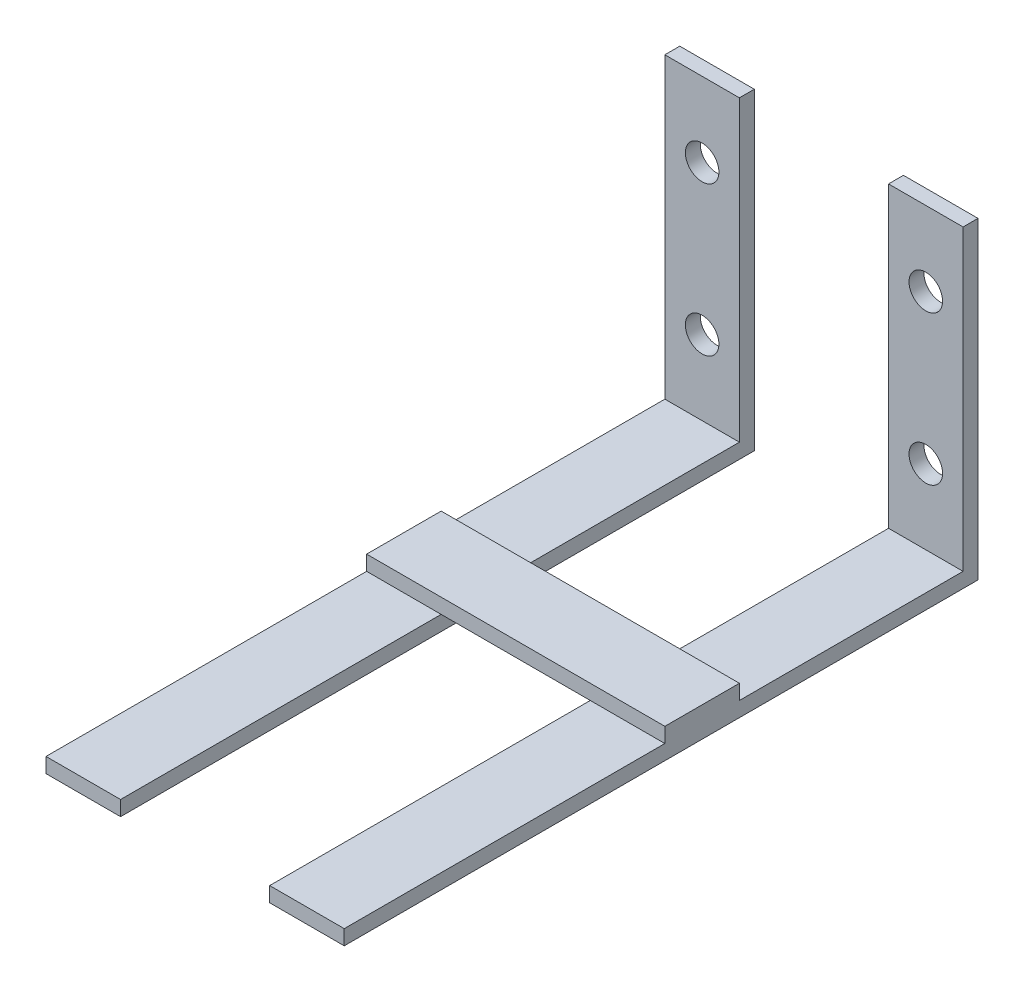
ISO-10303-21;
HEADER;
FILE_DESCRIPTION(('STEP AP214'),'2;1');
FILE_NAME('part.step','',(''),(''),'','','');
FILE_SCHEMA(('AUTOMOTIVE_DESIGN { 1 0 10303 214 1 1 1 1 }'));
ENDSEC;
DATA;
#1=APPLICATION_CONTEXT('core data for automotive mechanical design processes');
#2=APPLICATION_PROTOCOL_DEFINITION('international standard','automotive_design',2000,#1);
#3=PRODUCT_CONTEXT('',#1,'mechanical');
#4=PRODUCT('Part','Part','',(#3));
#5=PRODUCT_RELATED_PRODUCT_CATEGORY('part','',(#4));
#6=PRODUCT_DEFINITION_FORMATION('','',#4);
#7=PRODUCT_DEFINITION_CONTEXT('part definition',#1,'design');
#8=PRODUCT_DEFINITION('design','',#6,#7);
#9=PRODUCT_DEFINITION_SHAPE('','',#8);
#10=(LENGTH_UNIT() NAMED_UNIT(*) SI_UNIT(.MILLI.,.METRE.));
#11=(NAMED_UNIT(*) PLANE_ANGLE_UNIT() SI_UNIT($,.RADIAN.));
#12=(NAMED_UNIT(*) SI_UNIT($,.STERADIAN.) SOLID_ANGLE_UNIT());
#13=UNCERTAINTY_MEASURE_WITH_UNIT(LENGTH_MEASURE(1.E-05),#10,'distance_accuracy_value','');
#14=(GEOMETRIC_REPRESENTATION_CONTEXT(3) GLOBAL_UNCERTAINTY_ASSIGNED_CONTEXT((#13)) GLOBAL_UNIT_ASSIGNED_CONTEXT((#10,
#11,#12)) REPRESENTATION_CONTEXT('',''));
#15=CARTESIAN_POINT('',(0.,0.,0.));
#16=DIRECTION('',(0.,0.,1.));
#17=DIRECTION('',(1.,0.,0.));
#18=AXIS2_PLACEMENT_3D('',#15,#16,#17);
#19=CARTESIAN_POINT('',(-20.,42.,2.));
#20=DIRECTION('',(0.,0.,-1.));
#21=DIRECTION('',(-1.,0.,0.));
#22=AXIS2_PLACEMENT_3D('',#19,#20,#21);
#23=PLANE('',#22);
#24=DIRECTION('',(1.,0.,0.));
#25=VECTOR('',#24,1.);
#26=CARTESIAN_POINT('',(-20.,2.,2.));
#27=LINE('',#26,#25);
#28=CARTESIAN_POINT('',(-20.,2.,2.));
#29=VERTEX_POINT('',#28);
#30=CARTESIAN_POINT('',(-9.99999999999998,2.,2.));
#31=VERTEX_POINT('',#30);
#32=EDGE_CURVE('E258',#29,#31,#27,.T.);
#33=ORIENTED_EDGE('',*,*,#32,.T.);
#34=DIRECTION('',(0.,-1.,0.));
#35=VECTOR('',#34,1.);
#36=CARTESIAN_POINT('',(-9.99999999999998,42.,2.));
#37=LINE('',#36,#35);
#38=CARTESIAN_POINT('',(-9.99999999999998,42.,2.));
#39=VERTEX_POINT('',#38);
#40=EDGE_CURVE('E270',#39,#31,#37,.T.);
#41=ORIENTED_EDGE('',*,*,#40,.F.);
#42=DIRECTION('',(1.,0.,0.));
#43=VECTOR('',#42,1.);
#44=CARTESIAN_POINT('',(-20.,42.,2.));
#45=LINE('',#44,#43);
#46=CARTESIAN_POINT('',(-20.,42.,2.));
#47=VERTEX_POINT('',#46);
#48=EDGE_CURVE('E262',#47,#39,#45,.T.);
#49=ORIENTED_EDGE('',*,*,#48,.F.);
#50=DIRECTION('',(0.,-1.,0.));
#51=VECTOR('',#50,1.);
#52=CARTESIAN_POINT('',(-20.,42.,2.));
#53=LINE('',#52,#51);
#54=EDGE_CURVE('E275',#47,#29,#53,.T.);
#55=ORIENTED_EDGE('',*,*,#54,.T.);
#56=EDGE_LOOP('',(#33,#41,#49,#55));
#57=FACE_BOUND('',#56,.T.);
#58=CARTESIAN_POINT('',(-15.,12.,2.));
#59=DIRECTION('',(0.,0.,1.));
#60=DIRECTION('',(1.,0.,0.));
#61=AXIS2_PLACEMENT_3D('',#58,#59,#60);
#62=CIRCLE('',#61,2.25);
#63=CARTESIAN_POINT('',(-12.75,12.,2.));
#64=VERTEX_POINT('',#63);
#65=EDGE_CURVE('E661',#64,#64,#62,.T.);
#66=ORIENTED_EDGE('',*,*,#65,.F.);
#67=EDGE_LOOP('',(#66));
#68=FACE_BOUND('',#67,.T.);
#69=CARTESIAN_POINT('',(-15.,32.,2.));
#70=DIRECTION('',(0.,0.,1.));
#71=DIRECTION('',(1.,0.,0.));
#72=AXIS2_PLACEMENT_3D('',#69,#70,#71);
#73=CIRCLE('',#72,2.25);
#74=CARTESIAN_POINT('',(-12.75,32.,2.));
#75=VERTEX_POINT('',#74);
#76=EDGE_CURVE('E658',#75,#75,#73,.T.);
#77=ORIENTED_EDGE('',*,*,#76,.F.);
#78=EDGE_LOOP('',(#77));
#79=FACE_BOUND('',#78,.T.);
#80=ADVANCED_FACE('F37',(#57,#68,#79),#23,.F.);
#81=CARTESIAN_POINT('',(20.,42.,2.));
#82=DIRECTION('',(0.,0.,-1.));
#83=DIRECTION('',(-1.,0.,0.));
#84=AXIS2_PLACEMENT_3D('',#81,#82,#83);
#85=PLANE('',#84);
#86=DIRECTION('',(1.,0.,0.));
#87=VECTOR('',#86,1.);
#88=CARTESIAN_POINT('',(20.,2.,2.));
#89=LINE('',#88,#87);
#90=CARTESIAN_POINT('',(10.,2.,2.));
#91=VERTEX_POINT('',#90);
#92=CARTESIAN_POINT('',(20.,2.,2.));
#93=VERTEX_POINT('',#92);
#94=EDGE_CURVE('E165',#91,#93,#89,.T.);
#95=ORIENTED_EDGE('',*,*,#94,.T.);
#96=DIRECTION('',(0.,-1.,0.));
#97=VECTOR('',#96,1.);
#98=CARTESIAN_POINT('',(20.,42.,2.));
#99=LINE('',#98,#97);
#100=CARTESIAN_POINT('',(20.,42.,2.));
#101=VERTEX_POINT('',#100);
#102=EDGE_CURVE('E180',#101,#93,#99,.T.);
#103=ORIENTED_EDGE('',*,*,#102,.F.);
#104=DIRECTION('',(1.,0.,0.));
#105=VECTOR('',#104,1.);
#106=CARTESIAN_POINT('',(20.,42.,2.));
#107=LINE('',#106,#105);
#108=CARTESIAN_POINT('',(9.99999999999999,42.,2.));
#109=VERTEX_POINT('',#108);
#110=EDGE_CURVE('E190',#109,#101,#107,.T.);
#111=ORIENTED_EDGE('',*,*,#110,.F.);
#112=DIRECTION('',(0.,-1.,0.));
#113=VECTOR('',#112,1.);
#114=CARTESIAN_POINT('',(9.99999999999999,42.,2.));
#115=LINE('',#114,#113);
#116=EDGE_CURVE('E183',#109,#91,#115,.T.);
#117=ORIENTED_EDGE('',*,*,#116,.T.);
#118=EDGE_LOOP('',(#95,#103,#111,#117));
#119=FACE_BOUND('',#118,.T.);
#120=CARTESIAN_POINT('',(15.,12.,2.));
#121=DIRECTION('',(0.,0.,1.));
#122=DIRECTION('',(1.,0.,0.));
#123=AXIS2_PLACEMENT_3D('',#120,#121,#122);
#124=CIRCLE('',#123,2.25);
#125=CARTESIAN_POINT('',(17.25,12.,2.));
#126=VERTEX_POINT('',#125);
#127=EDGE_CURVE('E675',#126,#126,#124,.T.);
#128=ORIENTED_EDGE('',*,*,#127,.F.);
#129=EDGE_LOOP('',(#128));
#130=FACE_BOUND('',#129,.T.);
#131=CARTESIAN_POINT('',(15.,32.,2.));
#132=DIRECTION('',(0.,0.,1.));
#133=DIRECTION('',(1.,0.,0.));
#134=AXIS2_PLACEMENT_3D('',#131,#132,#133);
#135=CIRCLE('',#134,2.25);
#136=CARTESIAN_POINT('',(17.25,32.,2.));
#137=VERTEX_POINT('',#136);
#138=EDGE_CURVE('E669',#137,#137,#135,.T.);
#139=ORIENTED_EDGE('',*,*,#138,.F.);
#140=EDGE_LOOP('',(#139));
#141=FACE_BOUND('',#140,.T.);
#142=ADVANCED_FACE('F177',(#119,#130,#141),#85,.F.);
#143=CARTESIAN_POINT('',(0.,2.,0.));
#144=DIRECTION('',(0.,1.,0.));
#145=DIRECTION('',(0.,0.,1.));
#146=AXIS2_PLACEMENT_3D('',#143,#144,#145);
#147=PLANE('',#146);
#148=DIRECTION('',(0.,0.,1.));
#149=VECTOR('',#148,1.);
#150=CARTESIAN_POINT('',(10.,2.,0.));
#151=LINE('',#150,#149);
#152=CARTESIAN_POINT('',(10.,2.,32.));
#153=VERTEX_POINT('',#152);
#154=CARTESIAN_POINT('',(10.,2.,42.));
#155=VERTEX_POINT('',#154);
#156=EDGE_CURVE('E227',#153,#155,#151,.T.);
#157=ORIENTED_EDGE('',*,*,#156,.T.);
#158=DIRECTION('',(1.,0.,0.));
#159=VECTOR('',#158,1.);
#160=CARTESIAN_POINT('',(-20.,2.,42.));
#161=LINE('',#160,#159);
#162=CARTESIAN_POINT('',(-9.99999999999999,2.,42.));
#163=VERTEX_POINT('',#162);
#164=EDGE_CURVE('E230',#163,#155,#161,.T.);
#165=ORIENTED_EDGE('',*,*,#164,.F.);
#166=DIRECTION('',(0.,0.,-1.));
#167=VECTOR('',#166,1.);
#168=CARTESIAN_POINT('',(-10.,2.,0.));
#169=LINE('',#168,#167);
#170=CARTESIAN_POINT('',(-9.99999999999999,2.,32.));
#171=VERTEX_POINT('',#170);
#172=EDGE_CURVE('E255',#163,#171,#169,.T.);
#173=ORIENTED_EDGE('',*,*,#172,.T.);
#174=DIRECTION('',(-1.,0.,0.));
#175=VECTOR('',#174,1.);
#176=CARTESIAN_POINT('',(-20.,2.,32.));
#177=LINE('',#176,#175);
#178=EDGE_CURVE('E60',#153,#171,#177,.T.);
#179=ORIENTED_EDGE('',*,*,#178,.F.);
#180=EDGE_LOOP('',(#157,#165,#173,#179));
#181=FACE_BOUND('',#180,.T.);
#182=ADVANCED_FACE('F328',(#181),#147,.F.);
#183=CARTESIAN_POINT('',(0.,2.,0.));
#184=DIRECTION('',(0.,-1.,0.));
#185=DIRECTION('',(0.,0.,-1.));
#186=AXIS2_PLACEMENT_3D('',#183,#184,#185);
#187=PLANE('',#186);
#188=CARTESIAN_POINT('',(-20.,2.,42.));
#189=VERTEX_POINT('',#188);
#190=EDGE_CURVE('E241',#189,#163,#161,.T.);
#191=ORIENTED_EDGE('',*,*,#190,.F.);
#192=DIRECTION('',(0.,0.,1.));
#193=VECTOR('',#192,1.);
#194=CARTESIAN_POINT('',(-20.,2.,0.));
#195=LINE('',#194,#193);
#196=CARTESIAN_POINT('',(-20.,2.,85.));
#197=VERTEX_POINT('',#196);
#198=EDGE_CURVE('E282',#189,#197,#195,.T.);
#199=ORIENTED_EDGE('',*,*,#198,.T.);
#200=DIRECTION('',(1.,0.,0.));
#201=VECTOR('',#200,1.);
#202=CARTESIAN_POINT('',(-9.99999999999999,2.,85.));
#203=LINE('',#202,#201);
#204=CARTESIAN_POINT('',(-9.99999999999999,2.,85.));
#205=VERTEX_POINT('',#204);
#206=EDGE_CURVE('E286',#197,#205,#203,.T.);
#207=ORIENTED_EDGE('',*,*,#206,.T.);
#208=DIRECTION('',(0.,0.,-1.));
#209=VECTOR('',#208,1.);
#210=CARTESIAN_POINT('',(-10.,2.,0.));
#211=LINE('',#210,#209);
#212=EDGE_CURVE('E279',#205,#163,#211,.T.);
#213=ORIENTED_EDGE('',*,*,#212,.T.);
#214=EDGE_LOOP('',(#191,#199,#207,#213));
#215=FACE_BOUND('',#214,.T.);
#216=ADVANCED_FACE('F324',(#215),#187,.F.);
#217=CARTESIAN_POINT('',(-20.,2.,32.));
#218=VERTEX_POINT('',#217);
#219=EDGE_CURVE('E244',#171,#218,#177,.T.);
#220=ORIENTED_EDGE('',*,*,#219,.F.);
#221=EDGE_CURVE('E283',#171,#31,#211,.T.);
#222=ORIENTED_EDGE('',*,*,#221,.T.);
#223=ORIENTED_EDGE('',*,*,#32,.F.);
#224=EDGE_CURVE('E284',#29,#218,#195,.T.);
#225=ORIENTED_EDGE('',*,*,#224,.T.);
#226=EDGE_LOOP('',(#220,#222,#223,#225));
#227=FACE_BOUND('',#226,.T.);
#228=ADVANCED_FACE('F342',(#227),#187,.F.);
#229=CARTESIAN_POINT('',(-10.,2.,0.));
#230=DIRECTION('',(-1.,0.,0.));
#231=DIRECTION('',(0.,0.,1.));
#232=AXIS2_PLACEMENT_3D('',#229,#230,#231);
#233=PLANE('',#232);
#234=DIRECTION('',(0.,0.,-1.));
#235=VECTOR('',#234,1.);
#236=CARTESIAN_POINT('',(-10.,0.,0.));
#237=LINE('',#236,#235);
#238=CARTESIAN_POINT('',(-9.99999999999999,0.,85.));
#239=VERTEX_POINT('',#238);
#240=CARTESIAN_POINT('',(-10.,0.,0.));
#241=VERTEX_POINT('',#240);
#242=EDGE_CURVE('E278',#239,#241,#237,.T.);
#243=ORIENTED_EDGE('',*,*,#242,.T.);
#244=DIRECTION('',(0.,-1.,0.));
#245=VECTOR('',#244,1.);
#246=CARTESIAN_POINT('',(-10.,2.,0.));
#247=LINE('',#246,#245);
#248=CARTESIAN_POINT('',(-9.99999999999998,42.,0.));
#249=VERTEX_POINT('',#248);
#250=EDGE_CURVE('E11',#249,#241,#247,.T.);
#251=ORIENTED_EDGE('',*,*,#250,.F.);
#252=DIRECTION('',(0.,0.,-1.));
#253=VECTOR('',#252,1.);
#254=CARTESIAN_POINT('',(-9.99999999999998,42.,0.));
#255=LINE('',#254,#253);
#256=EDGE_CURVE('E264',#39,#249,#255,.T.);
#257=ORIENTED_EDGE('',*,*,#256,.F.);
#258=ORIENTED_EDGE('',*,*,#40,.T.);
#259=ORIENTED_EDGE('',*,*,#221,.F.);
#260=ORIENTED_EDGE('',*,*,#172,.F.);
#261=ORIENTED_EDGE('',*,*,#212,.F.);
#262=DIRECTION('',(0.,-1.,0.));
#263=VECTOR('',#262,1.);
#264=CARTESIAN_POINT('',(-9.99999999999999,2.,85.));
#265=LINE('',#264,#263);
#266=EDGE_CURVE('E288',#205,#239,#265,.T.);
#267=ORIENTED_EDGE('',*,*,#266,.T.);
#268=EDGE_LOOP('',(#243,#251,#257,#258,#259,#260,#261,#267));
#269=FACE_BOUND('',#268,.T.);
#270=ADVANCED_FACE('F39',(#269),#233,.F.);
#271=CARTESIAN_POINT('',(-10.,2.,0.));
#272=DIRECTION('',(0.,0.,1.));
#273=DIRECTION('',(1.,0.,0.));
#274=AXIS2_PLACEMENT_3D('',#271,#272,#273);
#275=PLANE('',#274);
#276=CARTESIAN_POINT('',(-15.,32.,0.));
#277=DIRECTION('',(0.,0.,1.));
#278=DIRECTION('',(1.,0.,0.));
#279=AXIS2_PLACEMENT_3D('',#276,#277,#278);
#280=CIRCLE('',#279,2.25);
#281=CARTESIAN_POINT('',(-12.75,32.,0.));
#282=VERTEX_POINT('',#281);
#283=EDGE_CURVE('E655',#282,#282,#280,.T.);
#284=ORIENTED_EDGE('',*,*,#283,.T.);
#285=EDGE_LOOP('',(#284));
#286=FACE_BOUND('',#285,.T.);
#287=CARTESIAN_POINT('',(-15.,12.,0.));
#288=DIRECTION('',(0.,0.,1.));
#289=DIRECTION('',(1.,0.,0.));
#290=AXIS2_PLACEMENT_3D('',#287,#288,#289);
#291=CIRCLE('',#290,2.25);
#292=CARTESIAN_POINT('',(-12.75,12.,0.));
#293=VERTEX_POINT('',#292);
#294=EDGE_CURVE('E666',#293,#293,#291,.T.);
#295=ORIENTED_EDGE('',*,*,#294,.T.);
#296=EDGE_LOOP('',(#295));
#297=FACE_BOUND('',#296,.T.);
#298=DIRECTION('',(-1.,0.,0.));
#299=VECTOR('',#298,1.);
#300=CARTESIAN_POINT('',(-10.,0.,0.));
#301=LINE('',#300,#299);
#302=CARTESIAN_POINT('',(-20.,0.,0.));
#303=VERTEX_POINT('',#302);
#304=EDGE_CURVE('E291',#241,#303,#301,.T.);
#305=ORIENTED_EDGE('',*,*,#304,.T.);
#306=DIRECTION('',(0.,-1.,0.));
#307=VECTOR('',#306,1.);
#308=CARTESIAN_POINT('',(-20.,2.,0.));
#309=LINE('',#308,#307);
#310=CARTESIAN_POINT('',(-20.,42.,0.));
#311=VERTEX_POINT('',#310);
#312=EDGE_CURVE('E45',#311,#303,#309,.T.);
#313=ORIENTED_EDGE('',*,*,#312,.F.);
#314=DIRECTION('',(-1.,0.,0.));
#315=VECTOR('',#314,1.);
#316=CARTESIAN_POINT('',(-20.,42.,0.));
#317=LINE('',#316,#315);
#318=EDGE_CURVE('E267',#249,#311,#317,.T.);
#319=ORIENTED_EDGE('',*,*,#318,.F.);
#320=ORIENTED_EDGE('',*,*,#250,.T.);
#321=EDGE_LOOP('',(#305,#313,#319,#320));
#322=FACE_BOUND('',#321,.T.);
#323=ADVANCED_FACE('F349',(#286,#297,#322),#275,.F.);
#324=CARTESIAN_POINT('',(-20.,2.,0.));
#325=DIRECTION('',(1.,0.,0.));
#326=DIRECTION('',(0.,0.,-1.));
#327=AXIS2_PLACEMENT_3D('',#324,#325,#326);
#328=PLANE('',#327);
#329=DIRECTION('',(0.,0.,1.));
#330=VECTOR('',#329,1.);
#331=CARTESIAN_POINT('',(-20.,0.,0.));
#332=LINE('',#331,#330);
#333=CARTESIAN_POINT('',(-20.,0.,85.));
#334=VERTEX_POINT('',#333);
#335=EDGE_CURVE('E293',#303,#334,#332,.T.);
#336=ORIENTED_EDGE('',*,*,#335,.T.);
#337=DIRECTION('',(0.,-1.,0.));
#338=VECTOR('',#337,1.);
#339=CARTESIAN_POINT('',(-20.,2.,85.));
#340=LINE('',#339,#338);
#341=EDGE_CURVE('E299',#197,#334,#340,.T.);
#342=ORIENTED_EDGE('',*,*,#341,.F.);
#343=ORIENTED_EDGE('',*,*,#198,.F.);
#344=DIRECTION('',(0.,-1.,0.));
#345=VECTOR('',#344,1.);
#346=CARTESIAN_POINT('',(-20.,4.,42.));
#347=LINE('',#346,#345);
#348=CARTESIAN_POINT('',(-20.,4.,42.));
#349=VERTEX_POINT('',#348);
#350=EDGE_CURVE('E252',#349,#189,#347,.T.);
#351=ORIENTED_EDGE('',*,*,#350,.F.);
#352=DIRECTION('',(0.,0.,1.));
#353=VECTOR('',#352,1.);
#354=CARTESIAN_POINT('',(-20.,4.,32.));
#355=LINE('',#354,#353);
#356=CARTESIAN_POINT('',(-20.,4.,32.));
#357=VERTEX_POINT('',#356);
#358=EDGE_CURVE('E231',#357,#349,#355,.T.);
#359=ORIENTED_EDGE('',*,*,#358,.F.);
#360=DIRECTION('',(0.,-1.,0.));
#361=VECTOR('',#360,1.);
#362=CARTESIAN_POINT('',(-20.,4.,32.));
#363=LINE('',#362,#361);
#364=EDGE_CURVE('E240',#357,#218,#363,.T.);
#365=ORIENTED_EDGE('',*,*,#364,.T.);
#366=ORIENTED_EDGE('',*,*,#224,.F.);
#367=ORIENTED_EDGE('',*,*,#54,.F.);
#368=DIRECTION('',(0.,0.,1.));
#369=VECTOR('',#368,1.);
#370=CARTESIAN_POINT('',(-20.,42.,0.));
#371=LINE('',#370,#369);
#372=EDGE_CURVE('E259',#311,#47,#371,.T.);
#373=ORIENTED_EDGE('',*,*,#372,.F.);
#374=ORIENTED_EDGE('',*,*,#312,.T.);
#375=EDGE_LOOP('',(#336,#342,#343,#351,#359,#365,#366,#367,#373,#374));
#376=FACE_BOUND('',#375,.T.);
#377=ADVANCED_FACE('F305',(#376),#328,.F.);
#378=CARTESIAN_POINT('',(-9.99999999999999,2.,85.));
#379=DIRECTION('',(0.,0.,-1.));
#380=DIRECTION('',(-1.,0.,0.));
#381=AXIS2_PLACEMENT_3D('',#378,#379,#380);
#382=PLANE('',#381);
#383=DIRECTION('',(1.,0.,0.));
#384=VECTOR('',#383,1.);
#385=CARTESIAN_POINT('',(-9.99999999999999,0.,85.));
#386=LINE('',#385,#384);
#387=EDGE_CURVE('E295',#334,#239,#386,.T.);
#388=ORIENTED_EDGE('',*,*,#387,.T.);
#389=ORIENTED_EDGE('',*,*,#266,.F.);
#390=ORIENTED_EDGE('',*,*,#206,.F.);
#391=ORIENTED_EDGE('',*,*,#341,.T.);
#392=EDGE_LOOP('',(#388,#389,#390,#391));
#393=FACE_BOUND('',#392,.T.);
#394=ADVANCED_FACE('F316',(#393),#382,.F.);
#395=CARTESIAN_POINT('',(0.,0.,0.));
#396=DIRECTION('',(0.,-1.,0.));
#397=DIRECTION('',(0.,0.,-1.));
#398=AXIS2_PLACEMENT_3D('',#395,#396,#397);
#399=PLANE('',#398);
#400=ORIENTED_EDGE('',*,*,#242,.F.);
#401=ORIENTED_EDGE('',*,*,#387,.F.);
#402=ORIENTED_EDGE('',*,*,#335,.F.);
#403=ORIENTED_EDGE('',*,*,#304,.F.);
#404=EDGE_LOOP('',(#400,#401,#402,#403));
#405=FACE_BOUND('',#404,.T.);
#406=ADVANCED_FACE('F313',(#405),#399,.T.);
#407=CARTESIAN_POINT('',(0.,42.,0.));
#408=DIRECTION('',(0.,1.,0.));
#409=DIRECTION('',(0.,0.,1.));
#410=AXIS2_PLACEMENT_3D('',#407,#408,#409);
#411=PLANE('',#410);
#412=ORIENTED_EDGE('',*,*,#372,.T.);
#413=ORIENTED_EDGE('',*,*,#48,.T.);
#414=ORIENTED_EDGE('',*,*,#256,.T.);
#415=ORIENTED_EDGE('',*,*,#318,.T.);
#416=EDGE_LOOP('',(#412,#413,#414,#415));
#417=FACE_BOUND('',#416,.T.);
#418=ADVANCED_FACE('F348',(#417),#411,.T.);
#419=CARTESIAN_POINT('',(-20.,4.,42.));
#420=DIRECTION('',(0.,0.,-1.));
#421=DIRECTION('',(-1.,0.,0.));
#422=AXIS2_PLACEMENT_3D('',#419,#420,#421);
#423=PLANE('',#422);
#424=ORIENTED_EDGE('',*,*,#190,.T.);
#425=ORIENTED_EDGE('',*,*,#164,.T.);
#426=DIRECTION('',(1.,0.,0.));
#427=VECTOR('',#426,1.);
#428=CARTESIAN_POINT('',(-20.,2.,42.));
#429=LINE('',#428,#427);
#430=CARTESIAN_POINT('',(20.,2.,42.));
#431=VERTEX_POINT('',#430);
#432=EDGE_CURVE('E221',#155,#431,#429,.T.);
#433=ORIENTED_EDGE('',*,*,#432,.T.);
#434=DIRECTION('',(0.,-1.,0.));
#435=VECTOR('',#434,1.);
#436=CARTESIAN_POINT('',(20.,4.,42.));
#437=LINE('',#436,#435);
#438=CARTESIAN_POINT('',(20.,4.,42.));
#439=VERTEX_POINT('',#438);
#440=EDGE_CURVE('E250',#439,#431,#437,.T.);
#441=ORIENTED_EDGE('',*,*,#440,.F.);
#442=DIRECTION('',(1.,0.,0.));
#443=VECTOR('',#442,1.);
#444=CARTESIAN_POINT('',(-20.,4.,42.));
#445=LINE('',#444,#443);
#446=EDGE_CURVE('E234',#349,#439,#445,.T.);
#447=ORIENTED_EDGE('',*,*,#446,.F.);
#448=ORIENTED_EDGE('',*,*,#350,.T.);
#449=EDGE_LOOP('',(#424,#425,#433,#441,#447,#448));
#450=FACE_BOUND('',#449,.T.);
#451=ADVANCED_FACE('F330',(#450),#423,.F.);
#452=CARTESIAN_POINT('',(20.,4.,32.));
#453=DIRECTION('',(-1.,0.,0.));
#454=DIRECTION('',(0.,0.,1.));
#455=AXIS2_PLACEMENT_3D('',#452,#453,#454);
#456=PLANE('',#455);
#457=ORIENTED_EDGE('',*,*,#440,.T.);
#458=DIRECTION('',(0.,0.,-1.));
#459=VECTOR('',#458,1.);
#460=CARTESIAN_POINT('',(20.,2.,0.));
#461=LINE('',#460,#459);
#462=CARTESIAN_POINT('',(20.,2.,85.));
#463=VERTEX_POINT('',#462);
#464=EDGE_CURVE('E171',#463,#431,#461,.T.);
#465=ORIENTED_EDGE('',*,*,#464,.F.);
#466=DIRECTION('',(0.,-1.,0.));
#467=VECTOR('',#466,1.);
#468=CARTESIAN_POINT('',(20.,2.,85.));
#469=LINE('',#468,#467);
#470=CARTESIAN_POINT('',(20.,0.,85.));
#471=VERTEX_POINT('',#470);
#472=EDGE_CURVE('E205',#463,#471,#469,.T.);
#473=ORIENTED_EDGE('',*,*,#472,.T.);
#474=DIRECTION('',(0.,0.,-1.));
#475=VECTOR('',#474,1.);
#476=CARTESIAN_POINT('',(20.,0.,0.));
#477=LINE('',#476,#475);
#478=CARTESIAN_POINT('',(20.,0.,0.));
#479=VERTEX_POINT('',#478);
#480=EDGE_CURVE('E215',#471,#479,#477,.T.);
#481=ORIENTED_EDGE('',*,*,#480,.T.);
#482=DIRECTION('',(0.,-1.,0.));
#483=VECTOR('',#482,1.);
#484=CARTESIAN_POINT('',(20.,2.,0.));
#485=LINE('',#484,#483);
#486=CARTESIAN_POINT('',(20.,42.,0.));
#487=VERTEX_POINT('',#486);
#488=EDGE_CURVE('E208',#487,#479,#485,.T.);
#489=ORIENTED_EDGE('',*,*,#488,.F.);
#490=DIRECTION('',(0.,0.,-1.));
#491=VECTOR('',#490,1.);
#492=CARTESIAN_POINT('',(20.,42.,0.));
#493=LINE('',#492,#491);
#494=EDGE_CURVE('E185',#101,#487,#493,.T.);
#495=ORIENTED_EDGE('',*,*,#494,.F.);
#496=ORIENTED_EDGE('',*,*,#102,.T.);
#497=CARTESIAN_POINT('',(20.,2.,32.));
#498=VERTEX_POINT('',#497);
#499=EDGE_CURVE('E162',#498,#93,#461,.T.);
#500=ORIENTED_EDGE('',*,*,#499,.F.);
#501=DIRECTION('',(0.,-1.,0.));
#502=VECTOR('',#501,1.);
#503=CARTESIAN_POINT('',(20.,4.,32.));
#504=LINE('',#503,#502);
#505=CARTESIAN_POINT('',(20.,4.,32.));
#506=VERTEX_POINT('',#505);
#507=EDGE_CURVE('E248',#506,#498,#504,.T.);
#508=ORIENTED_EDGE('',*,*,#507,.F.);
#509=DIRECTION('',(0.,0.,-1.));
#510=VECTOR('',#509,1.);
#511=CARTESIAN_POINT('',(20.,4.,32.));
#512=LINE('',#511,#510);
#513=EDGE_CURVE('E236',#439,#506,#512,.T.);
#514=ORIENTED_EDGE('',*,*,#513,.F.);
#515=EDGE_LOOP('',(#457,#465,#473,#481,#489,#495,#496,#500,#508,#514));
#516=FACE_BOUND('',#515,.T.);
#517=ADVANCED_FACE('F188',(#516),#456,.F.);
#518=CARTESIAN_POINT('',(-20.,4.,32.));
#519=DIRECTION('',(0.,0.,1.));
#520=DIRECTION('',(1.,0.,0.));
#521=AXIS2_PLACEMENT_3D('',#518,#519,#520);
#522=PLANE('',#521);
#523=EDGE_CURVE('E166',#498,#153,#177,.T.);
#524=ORIENTED_EDGE('',*,*,#523,.T.);
#525=ORIENTED_EDGE('',*,*,#178,.T.);
#526=ORIENTED_EDGE('',*,*,#219,.T.);
#527=ORIENTED_EDGE('',*,*,#364,.F.);
#528=DIRECTION('',(-1.,0.,0.));
#529=VECTOR('',#528,1.);
#530=CARTESIAN_POINT('',(-20.,4.,32.));
#531=LINE('',#530,#529);
#532=EDGE_CURVE('E238',#506,#357,#531,.T.);
#533=ORIENTED_EDGE('',*,*,#532,.F.);
#534=ORIENTED_EDGE('',*,*,#507,.T.);
#535=EDGE_LOOP('',(#524,#525,#526,#527,#533,#534));
#536=FACE_BOUND('',#535,.T.);
#537=ADVANCED_FACE('F340',(#536),#522,.F.);
#538=CARTESIAN_POINT('',(0.,4.,0.));
#539=DIRECTION('',(0.,1.,0.));
#540=DIRECTION('',(0.,0.,1.));
#541=AXIS2_PLACEMENT_3D('',#538,#539,#540);
#542=PLANE('',#541);
#543=ORIENTED_EDGE('',*,*,#358,.T.);
#544=ORIENTED_EDGE('',*,*,#446,.T.);
#545=ORIENTED_EDGE('',*,*,#513,.T.);
#546=ORIENTED_EDGE('',*,*,#532,.T.);
#547=EDGE_LOOP('',(#543,#544,#545,#546));
#548=FACE_BOUND('',#547,.T.);
#549=ADVANCED_FACE('F337',(#548),#542,.T.);
#550=CARTESIAN_POINT('',(0.,2.,0.));
#551=DIRECTION('',(0.,1.,0.));
#552=DIRECTION('',(0.,0.,1.));
#553=AXIS2_PLACEMENT_3D('',#550,#551,#552);
#554=PLANE('',#553);
#555=ORIENTED_EDGE('',*,*,#432,.F.);
#556=CARTESIAN_POINT('',(10.,2.,85.));
#557=VERTEX_POINT('',#556);
#558=EDGE_CURVE('E225',#155,#557,#151,.T.);
#559=ORIENTED_EDGE('',*,*,#558,.T.);
#560=DIRECTION('',(1.,0.,0.));
#561=VECTOR('',#560,1.);
#562=CARTESIAN_POINT('',(10.,2.,85.));
#563=LINE('',#562,#561);
#564=EDGE_CURVE('E223',#557,#463,#563,.T.);
#565=ORIENTED_EDGE('',*,*,#564,.T.);
#566=ORIENTED_EDGE('',*,*,#464,.T.);
#567=EDGE_LOOP('',(#555,#559,#565,#566));
#568=FACE_BOUND('',#567,.T.);
#569=ADVANCED_FACE('F410',(#568),#554,.T.);
#570=ORIENTED_EDGE('',*,*,#523,.F.);
#571=ORIENTED_EDGE('',*,*,#499,.T.);
#572=ORIENTED_EDGE('',*,*,#94,.F.);
#573=EDGE_CURVE('E52',#91,#153,#151,.T.);
#574=ORIENTED_EDGE('',*,*,#573,.T.);
#575=EDGE_LOOP('',(#570,#571,#572,#574));
#576=FACE_BOUND('',#575,.T.);
#577=ADVANCED_FACE('F164',(#576),#554,.T.);
#578=CARTESIAN_POINT('',(10.,2.,0.));
#579=DIRECTION('',(1.,0.,0.));
#580=DIRECTION('',(0.,0.,-1.));
#581=AXIS2_PLACEMENT_3D('',#578,#579,#580);
#582=PLANE('',#581);
#583=DIRECTION('',(0.,0.,1.));
#584=VECTOR('',#583,1.);
#585=CARTESIAN_POINT('',(10.,0.,0.));
#586=LINE('',#585,#584);
#587=CARTESIAN_POINT('',(10.,0.,0.));
#588=VERTEX_POINT('',#587);
#589=CARTESIAN_POINT('',(10.,0.,85.));
#590=VERTEX_POINT('',#589);
#591=EDGE_CURVE('E219',#588,#590,#586,.T.);
#592=ORIENTED_EDGE('',*,*,#591,.T.);
#593=DIRECTION('',(0.,-1.,0.));
#594=VECTOR('',#593,1.);
#595=CARTESIAN_POINT('',(10.,2.,85.));
#596=LINE('',#595,#594);
#597=EDGE_CURVE('E184',#557,#590,#596,.T.);
#598=ORIENTED_EDGE('',*,*,#597,.F.);
#599=ORIENTED_EDGE('',*,*,#558,.F.);
#600=ORIENTED_EDGE('',*,*,#156,.F.);
#601=ORIENTED_EDGE('',*,*,#573,.F.);
#602=ORIENTED_EDGE('',*,*,#116,.F.);
#603=DIRECTION('',(0.,0.,1.));
#604=VECTOR('',#603,1.);
#605=CARTESIAN_POINT('',(9.99999999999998,42.,0.));
#606=LINE('',#605,#604);
#607=CARTESIAN_POINT('',(9.99999999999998,42.,0.));
#608=VERTEX_POINT('',#607);
#609=EDGE_CURVE('E192',#608,#109,#606,.T.);
#610=ORIENTED_EDGE('',*,*,#609,.F.);
#611=DIRECTION('',(0.,-1.,0.));
#612=VECTOR('',#611,1.);
#613=CARTESIAN_POINT('',(10.,2.,0.));
#614=LINE('',#613,#612);
#615=EDGE_CURVE('E172',#608,#588,#614,.T.);
#616=ORIENTED_EDGE('',*,*,#615,.T.);
#617=EDGE_LOOP('',(#592,#598,#599,#600,#601,#602,#610,#616));
#618=FACE_BOUND('',#617,.T.);
#619=ADVANCED_FACE('F424',(#618),#582,.F.);
#620=CARTESIAN_POINT('',(10.,2.,85.));
#621=DIRECTION('',(0.,0.,-1.));
#622=DIRECTION('',(-1.,0.,0.));
#623=AXIS2_PLACEMENT_3D('',#620,#621,#622);
#624=PLANE('',#623);
#625=DIRECTION('',(1.,0.,0.));
#626=VECTOR('',#625,1.);
#627=CARTESIAN_POINT('',(10.,0.,85.));
#628=LINE('',#627,#626);
#629=EDGE_CURVE('E217',#590,#471,#628,.T.);
#630=ORIENTED_EDGE('',*,*,#629,.T.);
#631=ORIENTED_EDGE('',*,*,#472,.F.);
#632=ORIENTED_EDGE('',*,*,#564,.F.);
#633=ORIENTED_EDGE('',*,*,#597,.T.);
#634=EDGE_LOOP('',(#630,#631,#632,#633));
#635=FACE_BOUND('',#634,.T.);
#636=ADVANCED_FACE('F430',(#635),#624,.F.);
#637=CARTESIAN_POINT('',(10.,2.,0.));
#638=DIRECTION('',(0.,0.,1.));
#639=DIRECTION('',(1.,0.,0.));
#640=AXIS2_PLACEMENT_3D('',#637,#638,#639);
#641=PLANE('',#640);
#642=CARTESIAN_POINT('',(15.,32.,0.));
#643=DIRECTION('',(0.,0.,1.));
#644=DIRECTION('',(1.,0.,0.));
#645=AXIS2_PLACEMENT_3D('',#642,#643,#644);
#646=CIRCLE('',#645,2.25);
#647=CARTESIAN_POINT('',(17.25,32.,0.));
#648=VERTEX_POINT('',#647);
#649=EDGE_CURVE('E672',#648,#648,#646,.T.);
#650=ORIENTED_EDGE('',*,*,#649,.T.);
#651=EDGE_LOOP('',(#650));
#652=FACE_BOUND('',#651,.T.);
#653=CARTESIAN_POINT('',(15.,12.,0.));
#654=DIRECTION('',(0.,0.,1.));
#655=DIRECTION('',(1.,0.,0.));
#656=AXIS2_PLACEMENT_3D('',#653,#654,#655);
#657=CIRCLE('',#656,2.25);
#658=CARTESIAN_POINT('',(17.25,12.,0.));
#659=VERTEX_POINT('',#658);
#660=EDGE_CURVE('E194',#659,#659,#657,.T.);
#661=ORIENTED_EDGE('',*,*,#660,.T.);
#662=EDGE_LOOP('',(#661));
#663=FACE_BOUND('',#662,.T.);
#664=DIRECTION('',(-1.,0.,0.));
#665=VECTOR('',#664,1.);
#666=CARTESIAN_POINT('',(10.,0.,0.));
#667=LINE('',#666,#665);
#668=EDGE_CURVE('E213',#479,#588,#667,.T.);
#669=ORIENTED_EDGE('',*,*,#668,.T.);
#670=ORIENTED_EDGE('',*,*,#615,.F.);
#671=DIRECTION('',(-1.,0.,0.));
#672=VECTOR('',#671,1.);
#673=CARTESIAN_POINT('',(20.,42.,0.));
#674=LINE('',#673,#672);
#675=EDGE_CURVE('E199',#487,#608,#674,.T.);
#676=ORIENTED_EDGE('',*,*,#675,.F.);
#677=ORIENTED_EDGE('',*,*,#488,.T.);
#678=EDGE_LOOP('',(#669,#670,#676,#677));
#679=FACE_BOUND('',#678,.T.);
#680=ADVANCED_FACE('F438',(#652,#663,#679),#641,.F.);
#681=CARTESIAN_POINT('',(0.,0.,0.));
#682=DIRECTION('',(0.,1.,0.));
#683=DIRECTION('',(0.,0.,1.));
#684=AXIS2_PLACEMENT_3D('',#681,#682,#683);
#685=PLANE('',#684);
#686=ORIENTED_EDGE('',*,*,#591,.F.);
#687=ORIENTED_EDGE('',*,*,#668,.F.);
#688=ORIENTED_EDGE('',*,*,#480,.F.);
#689=ORIENTED_EDGE('',*,*,#629,.F.);
#690=EDGE_LOOP('',(#686,#687,#688,#689));
#691=FACE_BOUND('',#690,.T.);
#692=ADVANCED_FACE('F447',(#691),#685,.F.);
#693=CARTESIAN_POINT('',(0.,42.,0.));
#694=DIRECTION('',(0.,-1.,0.));
#695=DIRECTION('',(0.,0.,-1.));
#696=AXIS2_PLACEMENT_3D('',#693,#694,#695);
#697=PLANE('',#696);
#698=ORIENTED_EDGE('',*,*,#494,.T.);
#699=ORIENTED_EDGE('',*,*,#675,.T.);
#700=ORIENTED_EDGE('',*,*,#609,.T.);
#701=ORIENTED_EDGE('',*,*,#110,.T.);
#702=EDGE_LOOP('',(#698,#699,#700,#701));
#703=FACE_BOUND('',#702,.T.);
#704=ADVANCED_FACE('F455',(#703),#697,.F.);
#705=CARTESIAN_POINT('',(15.,12.,2.));
#706=DIRECTION('',(0.,0.,1.));
#707=DIRECTION('',(1.,0.,0.));
#708=AXIS2_PLACEMENT_3D('',#705,#706,#707);
#709=CYLINDRICAL_SURFACE('',#708,2.25);
#710=ORIENTED_EDGE('',*,*,#660,.F.);
#711=EDGE_LOOP('',(#710));
#712=FACE_BOUND('',#711,.T.);
#713=ORIENTED_EDGE('',*,*,#127,.T.);
#714=EDGE_LOOP('',(#713));
#715=FACE_BOUND('',#714,.T.);
#716=ADVANCED_FACE('F463',(#712,#715),#709,.F.);
#717=CARTESIAN_POINT('',(15.,32.,2.));
#718=DIRECTION('',(0.,0.,1.));
#719=DIRECTION('',(1.,0.,0.));
#720=AXIS2_PLACEMENT_3D('',#717,#718,#719);
#721=CYLINDRICAL_SURFACE('',#720,2.25);
#722=ORIENTED_EDGE('',*,*,#649,.F.);
#723=EDGE_LOOP('',(#722));
#724=FACE_BOUND('',#723,.T.);
#725=ORIENTED_EDGE('',*,*,#138,.T.);
#726=EDGE_LOOP('',(#725));
#727=FACE_BOUND('',#726,.T.);
#728=ADVANCED_FACE('F470',(#724,#727),#721,.F.);
#729=CARTESIAN_POINT('',(-15.,12.,2.));
#730=DIRECTION('',(0.,0.,1.));
#731=DIRECTION('',(1.,0.,0.));
#732=AXIS2_PLACEMENT_3D('',#729,#730,#731);
#733=CYLINDRICAL_SURFACE('',#732,2.25);
#734=ORIENTED_EDGE('',*,*,#294,.F.);
#735=EDGE_LOOP('',(#734));
#736=FACE_BOUND('',#735,.T.);
#737=ORIENTED_EDGE('',*,*,#65,.T.);
#738=EDGE_LOOP('',(#737));
#739=FACE_BOUND('',#738,.T.);
#740=ADVANCED_FACE('F478',(#736,#739),#733,.F.);
#741=CARTESIAN_POINT('',(-15.,32.,2.));
#742=DIRECTION('',(0.,0.,1.));
#743=DIRECTION('',(1.,0.,0.));
#744=AXIS2_PLACEMENT_3D('',#741,#742,#743);
#745=CYLINDRICAL_SURFACE('',#744,2.25);
#746=ORIENTED_EDGE('',*,*,#283,.F.);
#747=EDGE_LOOP('',(#746));
#748=FACE_BOUND('',#747,.T.);
#749=ORIENTED_EDGE('',*,*,#76,.T.);
#750=EDGE_LOOP('',(#749));
#751=FACE_BOUND('',#750,.T.);
#752=ADVANCED_FACE('F486',(#748,#751),#745,.F.);
#753=CLOSED_SHELL('',(#80,#142,#182,#216,#228,#270,#323,#377,#394,#406,#418,#451,#517,#537,#549,
#569,#577,#619,#636,#680,#692,#704,#716,#728,#740,#752));
#754=MANIFOLD_SOLID_BREP('B2',#753);
#755=ADVANCED_BREP_SHAPE_REPRESENTATION('',(#18,#754),#14);
#756=SHAPE_DEFINITION_REPRESENTATION(#9,#755);
ENDSEC;
END-ISO-10303-21;
